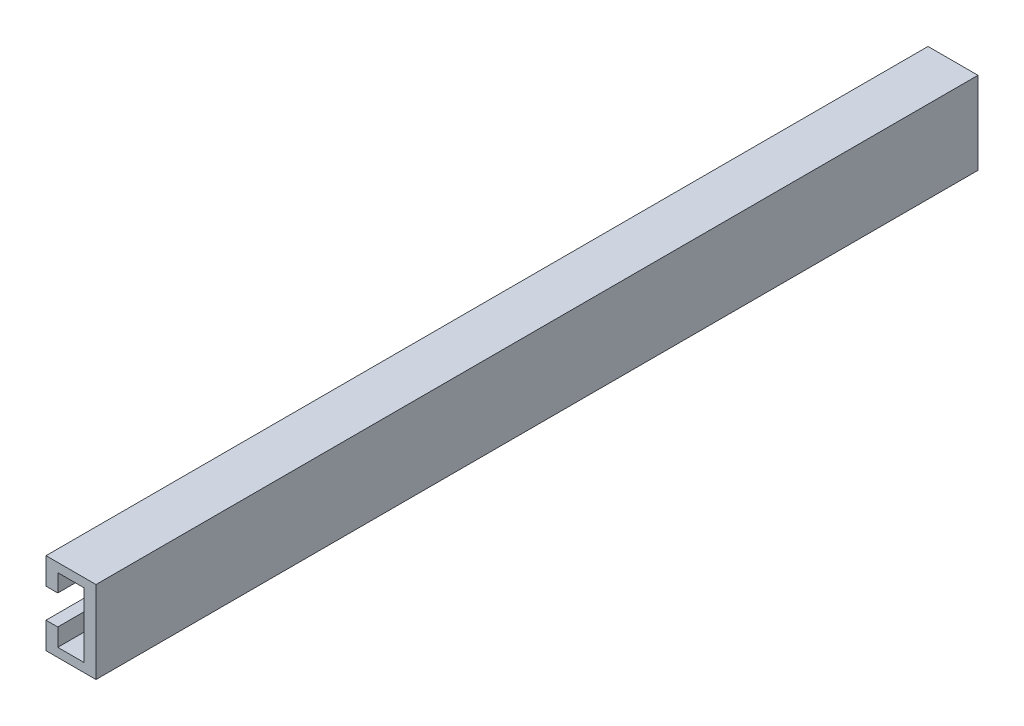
ISO-10303-21;
HEADER;
FILE_DESCRIPTION(('STEP AP214'),'2;1');
FILE_NAME('part.step','',(''),(''),'','','');
FILE_SCHEMA(('AUTOMOTIVE_DESIGN { 1 0 10303 214 1 1 1 1 }'));
ENDSEC;
DATA;
#1=APPLICATION_CONTEXT('core data for automotive mechanical design processes');
#2=APPLICATION_PROTOCOL_DEFINITION('international standard','automotive_design',2000,#1);
#3=PRODUCT_CONTEXT('',#1,'mechanical');
#4=PRODUCT('Part','Part','',(#3));
#5=PRODUCT_RELATED_PRODUCT_CATEGORY('part','',(#4));
#6=PRODUCT_DEFINITION_FORMATION('','',#4);
#7=PRODUCT_DEFINITION_CONTEXT('part definition',#1,'design');
#8=PRODUCT_DEFINITION('design','',#6,#7);
#9=PRODUCT_DEFINITION_SHAPE('','',#8);
#10=(LENGTH_UNIT() NAMED_UNIT(*) SI_UNIT(.MILLI.,.METRE.));
#11=(NAMED_UNIT(*) PLANE_ANGLE_UNIT() SI_UNIT($,.RADIAN.));
#12=(NAMED_UNIT(*) SI_UNIT($,.STERADIAN.) SOLID_ANGLE_UNIT());
#13=UNCERTAINTY_MEASURE_WITH_UNIT(LENGTH_MEASURE(1.E-05),#10,'distance_accuracy_value','');
#14=(GEOMETRIC_REPRESENTATION_CONTEXT(3) GLOBAL_UNCERTAINTY_ASSIGNED_CONTEXT((#13)) GLOBAL_UNIT_ASSIGNED_CONTEXT((#10,
#11,#12)) REPRESENTATION_CONTEXT('',''));
#15=CARTESIAN_POINT('',(0.,0.,0.));
#16=DIRECTION('',(0.,0.,1.));
#17=DIRECTION('',(1.,0.,0.));
#18=AXIS2_PLACEMENT_3D('',#15,#16,#17);
#19=CARTESIAN_POINT('',(-4.5,11.,150.));
#20=DIRECTION('',(-1.,0.,0.));
#21=DIRECTION('',(0.,-1.,0.));
#22=AXIS2_PLACEMENT_3D('',#19,#20,#21);
#23=PLANE('',#22);
#24=DIRECTION('',(0.,1.,0.));
#25=VECTOR('',#24,1.);
#26=CARTESIAN_POINT('',(-4.5,11.,-150.));
#27=LINE('',#26,#25);
#28=CARTESIAN_POINT('',(-4.5,5.,-150.));
#29=VERTEX_POINT('',#28);
#30=CARTESIAN_POINT('',(-4.5,11.,-150.));
#31=VERTEX_POINT('',#30);
#32=EDGE_CURVE('E153',#29,#31,#27,.T.);
#33=ORIENTED_EDGE('',*,*,#32,.T.);
#34=DIRECTION('',(0.,0.,-1.));
#35=VECTOR('',#34,1.);
#36=CARTESIAN_POINT('',(-4.5,11.,150.));
#37=LINE('',#36,#35);
#38=CARTESIAN_POINT('',(-4.5,11.,150.));
#39=VERTEX_POINT('',#38);
#40=EDGE_CURVE('E11',#39,#31,#37,.T.);
#41=ORIENTED_EDGE('',*,*,#40,.F.);
#42=DIRECTION('',(0.,1.,0.));
#43=VECTOR('',#42,1.);
#44=CARTESIAN_POINT('',(-4.5,11.,150.));
#45=LINE('',#44,#43);
#46=CARTESIAN_POINT('',(-4.5,5.,150.));
#47=VERTEX_POINT('',#46);
#48=EDGE_CURVE('E175',#47,#39,#45,.T.);
#49=ORIENTED_EDGE('',*,*,#48,.F.);
#50=DIRECTION('',(0.,0.,-1.));
#51=VECTOR('',#50,1.);
#52=CARTESIAN_POINT('',(-4.5,5.,150.));
#53=LINE('',#52,#51);
#54=EDGE_CURVE('E149',#47,#29,#53,.T.);
#55=ORIENTED_EDGE('',*,*,#54,.T.);
#56=EDGE_LOOP('',(#33,#41,#49,#55));
#57=FACE_BOUND('',#56,.T.);
#58=ADVANCED_FACE('F33',(#57),#23,.F.);
#59=CARTESIAN_POINT('',(-4.5,11.,150.));
#60=DIRECTION('',(0.,1.,0.));
#61=DIRECTION('',(0.,0.,1.));
#62=AXIS2_PLACEMENT_3D('',#59,#60,#61);
#63=PLANE('',#62);
#64=DIRECTION('',(1.,0.,0.));
#65=VECTOR('',#64,1.);
#66=CARTESIAN_POINT('',(-4.5,11.,-150.));
#67=LINE('',#66,#65);
#68=CARTESIAN_POINT('',(4.5,11.,-150.));
#69=VERTEX_POINT('',#68);
#70=EDGE_CURVE('E156',#31,#69,#67,.T.);
#71=ORIENTED_EDGE('',*,*,#70,.T.);
#72=DIRECTION('',(0.,0.,-1.));
#73=VECTOR('',#72,1.);
#74=CARTESIAN_POINT('',(4.5,11.,150.));
#75=LINE('',#74,#73);
#76=CARTESIAN_POINT('',(4.5,11.,150.));
#77=VERTEX_POINT('',#76);
#78=EDGE_CURVE('E41',#77,#69,#75,.T.);
#79=ORIENTED_EDGE('',*,*,#78,.F.);
#80=DIRECTION('',(1.,0.,0.));
#81=VECTOR('',#80,1.);
#82=CARTESIAN_POINT('',(-4.5,11.,150.));
#83=LINE('',#82,#81);
#84=EDGE_CURVE('E104',#39,#77,#83,.T.);
#85=ORIENTED_EDGE('',*,*,#84,.F.);
#86=ORIENTED_EDGE('',*,*,#40,.T.);
#87=EDGE_LOOP('',(#71,#79,#85,#86));
#88=FACE_BOUND('',#87,.T.);
#89=ADVANCED_FACE('F253',(#88),#63,.F.);
#90=CARTESIAN_POINT('',(4.5,11.,150.));
#91=DIRECTION('',(1.,0.,0.));
#92=DIRECTION('',(0.,1.,0.));
#93=AXIS2_PLACEMENT_3D('',#90,#91,#92);
#94=PLANE('',#93);
#95=DIRECTION('',(0.,-1.,0.));
#96=VECTOR('',#95,1.);
#97=CARTESIAN_POINT('',(4.5,11.,-150.));
#98=LINE('',#97,#96);
#99=CARTESIAN_POINT('',(4.5,-11.,-150.));
#100=VERTEX_POINT('',#99);
#101=EDGE_CURVE('E158',#69,#100,#98,.T.);
#102=ORIENTED_EDGE('',*,*,#101,.T.);
#103=DIRECTION('',(0.,0.,-1.));
#104=VECTOR('',#103,1.);
#105=CARTESIAN_POINT('',(4.5,-11.,150.));
#106=LINE('',#105,#104);
#107=CARTESIAN_POINT('',(4.5,-11.,150.));
#108=VERTEX_POINT('',#107);
#109=EDGE_CURVE('E194',#108,#100,#106,.T.);
#110=ORIENTED_EDGE('',*,*,#109,.F.);
#111=DIRECTION('',(0.,-1.,0.));
#112=VECTOR('',#111,1.);
#113=CARTESIAN_POINT('',(4.5,11.,150.));
#114=LINE('',#113,#112);
#115=EDGE_CURVE('E202',#77,#108,#114,.T.);
#116=ORIENTED_EDGE('',*,*,#115,.F.);
#117=ORIENTED_EDGE('',*,*,#78,.T.);
#118=EDGE_LOOP('',(#102,#110,#116,#117));
#119=FACE_BOUND('',#118,.T.);
#120=ADVANCED_FACE('F200',(#119),#94,.F.);
#121=CARTESIAN_POINT('',(-4.5,-11.,150.));
#122=DIRECTION('',(0.,-1.,0.));
#123=DIRECTION('',(0.,0.,-1.));
#124=AXIS2_PLACEMENT_3D('',#121,#122,#123);
#125=PLANE('',#124);
#126=DIRECTION('',(-1.,0.,0.));
#127=VECTOR('',#126,1.);
#128=CARTESIAN_POINT('',(-4.5,-11.,-150.));
#129=LINE('',#128,#127);
#130=CARTESIAN_POINT('',(-4.5,-11.,-150.));
#131=VERTEX_POINT('',#130);
#132=EDGE_CURVE('E160',#100,#131,#129,.T.);
#133=ORIENTED_EDGE('',*,*,#132,.T.);
#134=DIRECTION('',(0.,0.,-1.));
#135=VECTOR('',#134,1.);
#136=CARTESIAN_POINT('',(-4.5,-11.,150.));
#137=LINE('',#136,#135);
#138=CARTESIAN_POINT('',(-4.5,-11.,150.));
#139=VERTEX_POINT('',#138);
#140=EDGE_CURVE('E191',#139,#131,#137,.T.);
#141=ORIENTED_EDGE('',*,*,#140,.F.);
#142=DIRECTION('',(-1.,0.,0.));
#143=VECTOR('',#142,1.);
#144=CARTESIAN_POINT('',(-4.5,-11.,150.));
#145=LINE('',#144,#143);
#146=EDGE_CURVE('E220',#108,#139,#145,.T.);
#147=ORIENTED_EDGE('',*,*,#146,.F.);
#148=ORIENTED_EDGE('',*,*,#109,.T.);
#149=EDGE_LOOP('',(#133,#141,#147,#148));
#150=FACE_BOUND('',#149,.T.);
#151=ADVANCED_FACE('F211',(#150),#125,.F.);
#152=CARTESIAN_POINT('',(-4.5,-5.,150.));
#153=DIRECTION('',(-1.,0.,0.));
#154=DIRECTION('',(0.,0.,1.));
#155=AXIS2_PLACEMENT_3D('',#152,#153,#154);
#156=PLANE('',#155);
#157=DIRECTION('',(0.,1.,0.));
#158=VECTOR('',#157,1.);
#159=CARTESIAN_POINT('',(-4.5,-5.,-150.));
#160=LINE('',#159,#158);
#161=CARTESIAN_POINT('',(-4.5,-5.,-150.));
#162=VERTEX_POINT('',#161);
#163=EDGE_CURVE('E162',#131,#162,#160,.T.);
#164=ORIENTED_EDGE('',*,*,#163,.T.);
#165=DIRECTION('',(0.,0.,-1.));
#166=VECTOR('',#165,1.);
#167=CARTESIAN_POINT('',(-4.5,-5.,150.));
#168=LINE('',#167,#166);
#169=CARTESIAN_POINT('',(-4.5,-5.,150.));
#170=VERTEX_POINT('',#169);
#171=EDGE_CURVE('E188',#170,#162,#168,.T.);
#172=ORIENTED_EDGE('',*,*,#171,.F.);
#173=DIRECTION('',(0.,1.,0.));
#174=VECTOR('',#173,1.);
#175=CARTESIAN_POINT('',(-4.5,-5.,150.));
#176=LINE('',#175,#174);
#177=EDGE_CURVE('E217',#139,#170,#176,.T.);
#178=ORIENTED_EDGE('',*,*,#177,.F.);
#179=ORIENTED_EDGE('',*,*,#140,.T.);
#180=EDGE_LOOP('',(#164,#172,#178,#179));
#181=FACE_BOUND('',#180,.T.);
#182=ADVANCED_FACE('F215',(#181),#156,.F.);
#183=CARTESIAN_POINT('',(-4.5,-5.,150.));
#184=DIRECTION('',(0.,-1.,0.));
#185=DIRECTION('',(1.,0.,0.));
#186=AXIS2_PLACEMENT_3D('',#183,#184,#185);
#187=PLANE('',#186);
#188=DIRECTION('',(-1.,0.,0.));
#189=VECTOR('',#188,1.);
#190=CARTESIAN_POINT('',(-4.5,-5.,-150.));
#191=LINE('',#190,#189);
#192=CARTESIAN_POINT('',(-8.5,-5.,-150.));
#193=VERTEX_POINT('',#192);
#194=EDGE_CURVE('E164',#162,#193,#191,.T.);
#195=ORIENTED_EDGE('',*,*,#194,.T.);
#196=DIRECTION('',(0.,0.,-1.));
#197=VECTOR('',#196,1.);
#198=CARTESIAN_POINT('',(-8.5,-5.,150.));
#199=LINE('',#198,#197);
#200=CARTESIAN_POINT('',(-8.5,-5.,150.));
#201=VERTEX_POINT('',#200);
#202=EDGE_CURVE('E185',#201,#193,#199,.T.);
#203=ORIENTED_EDGE('',*,*,#202,.F.);
#204=DIRECTION('',(-1.,0.,0.));
#205=VECTOR('',#204,1.);
#206=CARTESIAN_POINT('',(-4.5,-5.,150.));
#207=LINE('',#206,#205);
#208=EDGE_CURVE('E219',#170,#201,#207,.T.);
#209=ORIENTED_EDGE('',*,*,#208,.F.);
#210=ORIENTED_EDGE('',*,*,#171,.T.);
#211=EDGE_LOOP('',(#195,#203,#209,#210));
#212=FACE_BOUND('',#211,.T.);
#213=ADVANCED_FACE('F266',(#212),#187,.F.);
#214=CARTESIAN_POINT('',(-8.5,-5.,150.));
#215=DIRECTION('',(1.,0.,0.));
#216=DIRECTION('',(0.,1.,0.));
#217=AXIS2_PLACEMENT_3D('',#214,#215,#216);
#218=PLANE('',#217);
#219=DIRECTION('',(0.,-1.,0.));
#220=VECTOR('',#219,1.);
#221=CARTESIAN_POINT('',(-8.5,-5.,-150.));
#222=LINE('',#221,#220);
#223=CARTESIAN_POINT('',(-8.5,-14.,-150.));
#224=VERTEX_POINT('',#223);
#225=EDGE_CURVE('E166',#193,#224,#222,.T.);
#226=ORIENTED_EDGE('',*,*,#225,.T.);
#227=DIRECTION('',(0.,0.,-1.));
#228=VECTOR('',#227,1.);
#229=CARTESIAN_POINT('',(-8.5,-14.,150.));
#230=LINE('',#229,#228);
#231=CARTESIAN_POINT('',(-8.5,-14.,150.));
#232=VERTEX_POINT('',#231);
#233=EDGE_CURVE('E182',#232,#224,#230,.T.);
#234=ORIENTED_EDGE('',*,*,#233,.F.);
#235=DIRECTION('',(0.,-1.,0.));
#236=VECTOR('',#235,1.);
#237=CARTESIAN_POINT('',(-8.5,-5.,150.));
#238=LINE('',#237,#236);
#239=EDGE_CURVE('E222',#201,#232,#238,.T.);
#240=ORIENTED_EDGE('',*,*,#239,.F.);
#241=ORIENTED_EDGE('',*,*,#202,.T.);
#242=EDGE_LOOP('',(#226,#234,#240,#241));
#243=FACE_BOUND('',#242,.T.);
#244=ADVANCED_FACE('F269',(#243),#218,.F.);
#245=CARTESIAN_POINT('',(-8.5,-14.,150.));
#246=DIRECTION('',(0.,1.,0.));
#247=DIRECTION('',(-1.,0.,0.));
#248=AXIS2_PLACEMENT_3D('',#245,#246,#247);
#249=PLANE('',#248);
#250=DIRECTION('',(1.,0.,0.));
#251=VECTOR('',#250,1.);
#252=CARTESIAN_POINT('',(-8.5,-14.,-150.));
#253=LINE('',#252,#251);
#254=CARTESIAN_POINT('',(8.5,-14.,-150.));
#255=VERTEX_POINT('',#254);
#256=EDGE_CURVE('E168',#224,#255,#253,.T.);
#257=ORIENTED_EDGE('',*,*,#256,.T.);
#258=DIRECTION('',(0.,0.,-1.));
#259=VECTOR('',#258,1.);
#260=CARTESIAN_POINT('',(8.5,-14.,150.));
#261=LINE('',#260,#259);
#262=CARTESIAN_POINT('',(8.5,-14.,150.));
#263=VERTEX_POINT('',#262);
#264=EDGE_CURVE('E179',#263,#255,#261,.T.);
#265=ORIENTED_EDGE('',*,*,#264,.F.);
#266=DIRECTION('',(1.,0.,0.));
#267=VECTOR('',#266,1.);
#268=CARTESIAN_POINT('',(-8.5,-14.,150.));
#269=LINE('',#268,#267);
#270=EDGE_CURVE('E228',#232,#263,#269,.T.);
#271=ORIENTED_EDGE('',*,*,#270,.F.);
#272=ORIENTED_EDGE('',*,*,#233,.T.);
#273=EDGE_LOOP('',(#257,#265,#271,#272));
#274=FACE_BOUND('',#273,.T.);
#275=ADVANCED_FACE('F234',(#274),#249,.F.);
#276=CARTESIAN_POINT('',(8.5,14.,150.));
#277=DIRECTION('',(-1.,0.,0.));
#278=DIRECTION('',(0.,-1.,0.));
#279=AXIS2_PLACEMENT_3D('',#276,#277,#278);
#280=PLANE('',#279);
#281=DIRECTION('',(0.,1.,0.));
#282=VECTOR('',#281,1.);
#283=CARTESIAN_POINT('',(8.5,14.,-150.));
#284=LINE('',#283,#282);
#285=CARTESIAN_POINT('',(8.5,14.,-150.));
#286=VERTEX_POINT('',#285);
#287=EDGE_CURVE('E170',#255,#286,#284,.T.);
#288=ORIENTED_EDGE('',*,*,#287,.T.);
#289=DIRECTION('',(0.,0.,-1.));
#290=VECTOR('',#289,1.);
#291=CARTESIAN_POINT('',(8.5,14.,150.));
#292=LINE('',#291,#290);
#293=CARTESIAN_POINT('',(8.5,14.,150.));
#294=VERTEX_POINT('',#293);
#295=EDGE_CURVE('E144',#294,#286,#292,.T.);
#296=ORIENTED_EDGE('',*,*,#295,.F.);
#297=DIRECTION('',(0.,1.,0.));
#298=VECTOR('',#297,1.);
#299=CARTESIAN_POINT('',(8.5,14.,150.));
#300=LINE('',#299,#298);
#301=EDGE_CURVE('E135',#263,#294,#300,.T.);
#302=ORIENTED_EDGE('',*,*,#301,.F.);
#303=ORIENTED_EDGE('',*,*,#264,.T.);
#304=EDGE_LOOP('',(#288,#296,#302,#303));
#305=FACE_BOUND('',#304,.T.);
#306=ADVANCED_FACE('F238',(#305),#280,.F.);
#307=CARTESIAN_POINT('',(-8.5,14.,150.));
#308=DIRECTION('',(0.,-1.,0.));
#309=DIRECTION('',(0.,0.,-1.));
#310=AXIS2_PLACEMENT_3D('',#307,#308,#309);
#311=PLANE('',#310);
#312=DIRECTION('',(-1.,0.,0.));
#313=VECTOR('',#312,1.);
#314=CARTESIAN_POINT('',(-8.5,14.,-150.));
#315=LINE('',#314,#313);
#316=CARTESIAN_POINT('',(-8.5,14.,-150.));
#317=VERTEX_POINT('',#316);
#318=EDGE_CURVE('E143',#286,#317,#315,.T.);
#319=ORIENTED_EDGE('',*,*,#318,.T.);
#320=DIRECTION('',(0.,0.,-1.));
#321=VECTOR('',#320,1.);
#322=CARTESIAN_POINT('',(-8.5,14.,150.));
#323=LINE('',#322,#321);
#324=CARTESIAN_POINT('',(-8.5,14.,150.));
#325=VERTEX_POINT('',#324);
#326=EDGE_CURVE('E140',#325,#317,#323,.T.);
#327=ORIENTED_EDGE('',*,*,#326,.F.);
#328=DIRECTION('',(-1.,0.,0.));
#329=VECTOR('',#328,1.);
#330=CARTESIAN_POINT('',(-8.5,14.,150.));
#331=LINE('',#330,#329);
#332=EDGE_CURVE('E129',#294,#325,#331,.T.);
#333=ORIENTED_EDGE('',*,*,#332,.F.);
#334=ORIENTED_EDGE('',*,*,#295,.T.);
#335=EDGE_LOOP('',(#319,#327,#333,#334));
#336=FACE_BOUND('',#335,.T.);
#337=ADVANCED_FACE('F141',(#336),#311,.F.);
#338=CARTESIAN_POINT('',(-8.5,14.,150.));
#339=DIRECTION('',(1.,0.,0.));
#340=DIRECTION('',(0.,1.,0.));
#341=AXIS2_PLACEMENT_3D('',#338,#339,#340);
#342=PLANE('',#341);
#343=DIRECTION('',(0.,-1.,0.));
#344=VECTOR('',#343,1.);
#345=CARTESIAN_POINT('',(-8.5,14.,-150.));
#346=LINE('',#345,#344);
#347=CARTESIAN_POINT('',(-8.5,5.,-150.));
#348=VERTEX_POINT('',#347);
#349=EDGE_CURVE('E90',#317,#348,#346,.T.);
#350=ORIENTED_EDGE('',*,*,#349,.T.);
#351=DIRECTION('',(0.,0.,-1.));
#352=VECTOR('',#351,1.);
#353=CARTESIAN_POINT('',(-8.5,5.,150.));
#354=LINE('',#353,#352);
#355=CARTESIAN_POINT('',(-8.5,5.,150.));
#356=VERTEX_POINT('',#355);
#357=EDGE_CURVE('E145',#356,#348,#354,.T.);
#358=ORIENTED_EDGE('',*,*,#357,.F.);
#359=DIRECTION('',(0.,-1.,0.));
#360=VECTOR('',#359,1.);
#361=CARTESIAN_POINT('',(-8.5,14.,150.));
#362=LINE('',#361,#360);
#363=EDGE_CURVE('E133',#325,#356,#362,.T.);
#364=ORIENTED_EDGE('',*,*,#363,.F.);
#365=ORIENTED_EDGE('',*,*,#326,.T.);
#366=EDGE_LOOP('',(#350,#358,#364,#365));
#367=FACE_BOUND('',#366,.T.);
#368=ADVANCED_FACE('F147',(#367),#342,.F.);
#369=CARTESIAN_POINT('',(-4.5,5.,150.));
#370=DIRECTION('',(0.,1.,0.));
#371=DIRECTION('',(-1.,0.,0.));
#372=AXIS2_PLACEMENT_3D('',#369,#370,#371);
#373=PLANE('',#372);
#374=DIRECTION('',(1.,0.,0.));
#375=VECTOR('',#374,1.);
#376=CARTESIAN_POINT('',(-4.5,5.,-150.));
#377=LINE('',#376,#375);
#378=EDGE_CURVE('E96',#348,#29,#377,.T.);
#379=ORIENTED_EDGE('',*,*,#378,.T.);
#380=ORIENTED_EDGE('',*,*,#54,.F.);
#381=DIRECTION('',(1.,0.,0.));
#382=VECTOR('',#381,1.);
#383=CARTESIAN_POINT('',(-4.5,5.,150.));
#384=LINE('',#383,#382);
#385=EDGE_CURVE('E49',#356,#47,#384,.T.);
#386=ORIENTED_EDGE('',*,*,#385,.F.);
#387=ORIENTED_EDGE('',*,*,#357,.T.);
#388=EDGE_LOOP('',(#379,#380,#386,#387));
#389=FACE_BOUND('',#388,.T.);
#390=ADVANCED_FACE('F242',(#389),#373,.F.);
#391=CARTESIAN_POINT('',(0.,0.,150.));
#392=DIRECTION('',(0.,0.,-1.));
#393=DIRECTION('',(-1.,0.,0.));
#394=AXIS2_PLACEMENT_3D('',#391,#392,#393);
#395=PLANE('',#394);
#396=ORIENTED_EDGE('',*,*,#48,.T.);
#397=ORIENTED_EDGE('',*,*,#84,.T.);
#398=ORIENTED_EDGE('',*,*,#115,.T.);
#399=ORIENTED_EDGE('',*,*,#146,.T.);
#400=ORIENTED_EDGE('',*,*,#177,.T.);
#401=ORIENTED_EDGE('',*,*,#208,.T.);
#402=ORIENTED_EDGE('',*,*,#239,.T.);
#403=ORIENTED_EDGE('',*,*,#270,.T.);
#404=ORIENTED_EDGE('',*,*,#301,.T.);
#405=ORIENTED_EDGE('',*,*,#332,.T.);
#406=ORIENTED_EDGE('',*,*,#363,.T.);
#407=ORIENTED_EDGE('',*,*,#385,.T.);
#408=EDGE_LOOP('',(#396,#397,#398,#399,#400,#401,#402,#403,#404,#405,#406,#407));
#409=FACE_BOUND('',#408,.T.);
#410=ADVANCED_FACE('F131',(#409),#395,.F.);
#411=CARTESIAN_POINT('',(0.,0.,-150.));
#412=DIRECTION('',(0.,0.,-1.));
#413=DIRECTION('',(-1.,0.,0.));
#414=AXIS2_PLACEMENT_3D('',#411,#412,#413);
#415=PLANE('',#414);
#416=ORIENTED_EDGE('',*,*,#32,.F.);
#417=ORIENTED_EDGE('',*,*,#378,.F.);
#418=ORIENTED_EDGE('',*,*,#349,.F.);
#419=ORIENTED_EDGE('',*,*,#318,.F.);
#420=ORIENTED_EDGE('',*,*,#287,.F.);
#421=ORIENTED_EDGE('',*,*,#256,.F.);
#422=ORIENTED_EDGE('',*,*,#225,.F.);
#423=ORIENTED_EDGE('',*,*,#194,.F.);
#424=ORIENTED_EDGE('',*,*,#163,.F.);
#425=ORIENTED_EDGE('',*,*,#132,.F.);
#426=ORIENTED_EDGE('',*,*,#101,.F.);
#427=ORIENTED_EDGE('',*,*,#70,.F.);
#428=EDGE_LOOP('',(#416,#417,#418,#419,#420,#421,#422,#423,#424,#425,#426,#427));
#429=FACE_BOUND('',#428,.T.);
#430=ADVANCED_FACE('F206',(#429),#415,.T.);
#431=CLOSED_SHELL('',(#58,#89,#120,#151,#182,#213,#244,#275,#306,#337,#368,#390,#410,#430));
#432=MANIFOLD_SOLID_BREP('B2',#431);
#433=ADVANCED_BREP_SHAPE_REPRESENTATION('',(#18,#432),#14);
#434=SHAPE_DEFINITION_REPRESENTATION(#9,#433);
ENDSEC;
END-ISO-10303-21;
